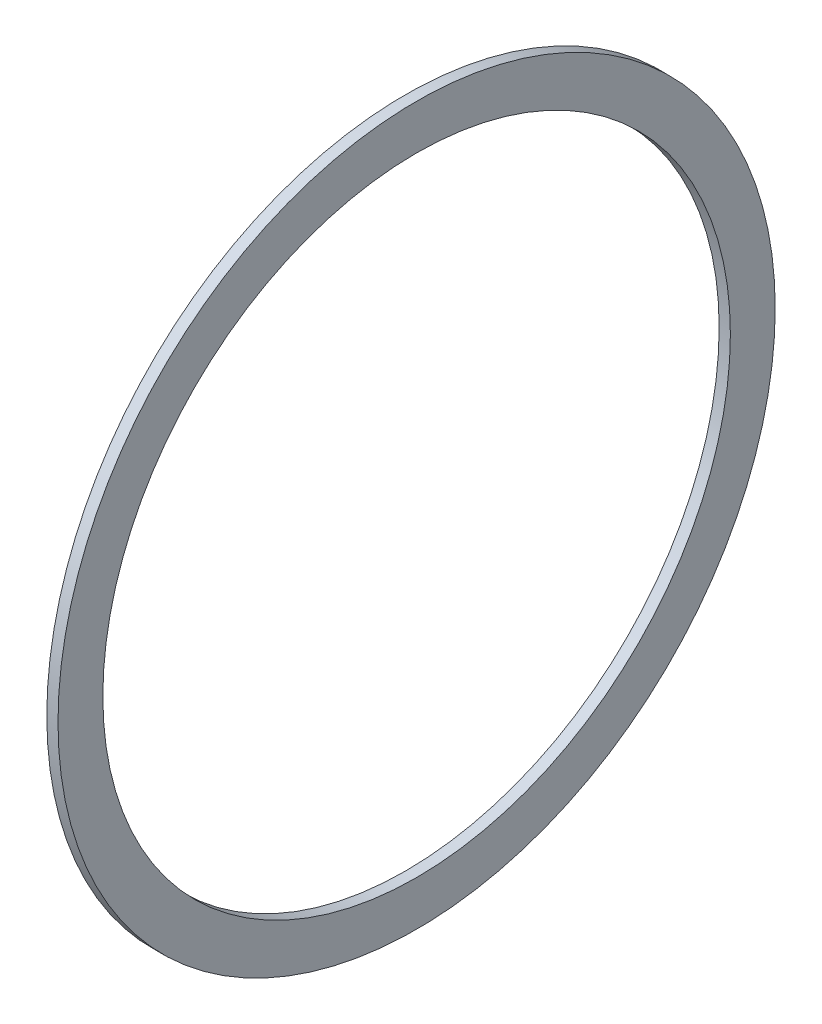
ISO-10303-21;
HEADER;
FILE_DESCRIPTION(('STEP AP214'),'2;1');
FILE_NAME('part.step','',(''),(''),'','','');
FILE_SCHEMA(('AUTOMOTIVE_DESIGN { 1 0 10303 214 1 1 1 1 }'));
ENDSEC;
DATA;
#1=APPLICATION_CONTEXT('core data for automotive mechanical design processes');
#2=APPLICATION_PROTOCOL_DEFINITION('international standard','automotive_design',2000,#1);
#3=PRODUCT_CONTEXT('',#1,'mechanical');
#4=PRODUCT('Part','Part','',(#3));
#5=PRODUCT_RELATED_PRODUCT_CATEGORY('part','',(#4));
#6=PRODUCT_DEFINITION_FORMATION('','',#4);
#7=PRODUCT_DEFINITION_CONTEXT('part definition',#1,'design');
#8=PRODUCT_DEFINITION('design','',#6,#7);
#9=PRODUCT_DEFINITION_SHAPE('','',#8);
#10=(LENGTH_UNIT() NAMED_UNIT(*) SI_UNIT(.MILLI.,.METRE.));
#11=(NAMED_UNIT(*) PLANE_ANGLE_UNIT() SI_UNIT($,.RADIAN.));
#12=(NAMED_UNIT(*) SI_UNIT($,.STERADIAN.) SOLID_ANGLE_UNIT());
#13=UNCERTAINTY_MEASURE_WITH_UNIT(LENGTH_MEASURE(1.E-05),#10,'distance_accuracy_value','');
#14=(GEOMETRIC_REPRESENTATION_CONTEXT(3) GLOBAL_UNCERTAINTY_ASSIGNED_CONTEXT((#13)) GLOBAL_UNIT_ASSIGNED_CONTEXT((#10,
#11,#12)) REPRESENTATION_CONTEXT('',''));
#15=CARTESIAN_POINT('',(0.,0.,0.));
#16=DIRECTION('',(0.,0.,1.));
#17=DIRECTION('',(1.,0.,0.));
#18=AXIS2_PLACEMENT_3D('',#15,#16,#17);
#19=CARTESIAN_POINT('',(0.,0.,-101.6));
#20=DIRECTION('',(1.,0.,0.));
#21=DIRECTION('',(0.,0.,-1.));
#22=AXIS2_PLACEMENT_3D('',#19,#20,#21);
#23=PLANE('',#22);
#24=CARTESIAN_POINT('',(0.,0.,0.));
#25=DIRECTION('',(-1.,0.,0.));
#26=DIRECTION('',(0.,0.,1.));
#27=AXIS2_PLACEMENT_3D('',#24,#25,#26);
#28=CIRCLE('',#27,88.9);
#29=CARTESIAN_POINT('',(0.,0.,88.9));
#30=VERTEX_POINT('',#29);
#31=EDGE_CURVE('E10',#30,#30,#28,.T.);
#32=ORIENTED_EDGE('',*,*,#31,.F.);
#33=EDGE_LOOP('',(#32));
#34=FACE_BOUND('',#33,.T.);
#35=CARTESIAN_POINT('',(0.,0.,0.));
#36=DIRECTION('',(-1.,0.,0.));
#37=DIRECTION('',(0.,0.,1.));
#38=AXIS2_PLACEMENT_3D('',#35,#36,#37);
#39=CIRCLE('',#38,101.6);
#40=CARTESIAN_POINT('',(0.,0.,101.6));
#41=VERTEX_POINT('',#40);
#42=EDGE_CURVE('E45',#41,#41,#39,.T.);
#43=ORIENTED_EDGE('',*,*,#42,.T.);
#44=EDGE_LOOP('',(#43));
#45=FACE_BOUND('',#44,.T.);
#46=ADVANCED_FACE('F31',(#34,#45),#23,.F.);
#47=CARTESIAN_POINT('',(0.,0.,0.));
#48=DIRECTION('',(-1.,0.,0.));
#49=DIRECTION('',(0.,0.,1.));
#50=AXIS2_PLACEMENT_3D('',#47,#48,#49);
#51=CYLINDRICAL_SURFACE('',#50,88.9);
#52=CARTESIAN_POINT('',(3.175,0.,0.));
#53=DIRECTION('',(-1.,0.,0.));
#54=DIRECTION('',(0.,0.,1.));
#55=AXIS2_PLACEMENT_3D('',#52,#53,#54);
#56=CIRCLE('',#55,88.9);
#57=CARTESIAN_POINT('',(3.175,0.,88.9));
#58=VERTEX_POINT('',#57);
#59=EDGE_CURVE('E37',#58,#58,#56,.T.);
#60=ORIENTED_EDGE('',*,*,#59,.F.);
#61=EDGE_LOOP('',(#60));
#62=FACE_BOUND('',#61,.T.);
#63=ORIENTED_EDGE('',*,*,#31,.T.);
#64=EDGE_LOOP('',(#63));
#65=FACE_BOUND('',#64,.T.);
#66=ADVANCED_FACE('F60',(#62,#65),#51,.F.);
#67=CARTESIAN_POINT('',(3.175,0.,-101.6));
#68=DIRECTION('',(-1.,0.,0.));
#69=DIRECTION('',(0.,0.,1.));
#70=AXIS2_PLACEMENT_3D('',#67,#68,#69);
#71=PLANE('',#70);
#72=CARTESIAN_POINT('',(3.175,0.,0.));
#73=DIRECTION('',(-1.,0.,0.));
#74=DIRECTION('',(0.,0.,1.));
#75=AXIS2_PLACEMENT_3D('',#72,#73,#74);
#76=CIRCLE('',#75,101.6);
#77=CARTESIAN_POINT('',(3.175,0.,101.6));
#78=VERTEX_POINT('',#77);
#79=EDGE_CURVE('E41',#78,#78,#76,.T.);
#80=ORIENTED_EDGE('',*,*,#79,.F.);
#81=EDGE_LOOP('',(#80));
#82=FACE_BOUND('',#81,.T.);
#83=ORIENTED_EDGE('',*,*,#59,.T.);
#84=EDGE_LOOP('',(#83));
#85=FACE_BOUND('',#84,.T.);
#86=ADVANCED_FACE('F55',(#82,#85),#71,.F.);
#87=CARTESIAN_POINT('',(0.,0.,0.));
#88=DIRECTION('',(-1.,0.,0.));
#89=DIRECTION('',(0.,0.,1.));
#90=AXIS2_PLACEMENT_3D('',#87,#88,#89);
#91=CYLINDRICAL_SURFACE('',#90,101.6);
#92=ORIENTED_EDGE('',*,*,#42,.F.);
#93=EDGE_LOOP('',(#92));
#94=FACE_BOUND('',#93,.T.);
#95=ORIENTED_EDGE('',*,*,#79,.T.);
#96=EDGE_LOOP('',(#95));
#97=FACE_BOUND('',#96,.T.);
#98=ADVANCED_FACE('F52',(#94,#97),#91,.T.);
#99=CLOSED_SHELL('',(#46,#66,#86,#98));
#100=MANIFOLD_SOLID_BREP('B2',#99);
#101=ADVANCED_BREP_SHAPE_REPRESENTATION('',(#18,#100),#14);
#102=SHAPE_DEFINITION_REPRESENTATION(#9,#101);
ENDSEC;
END-ISO-10303-21;
